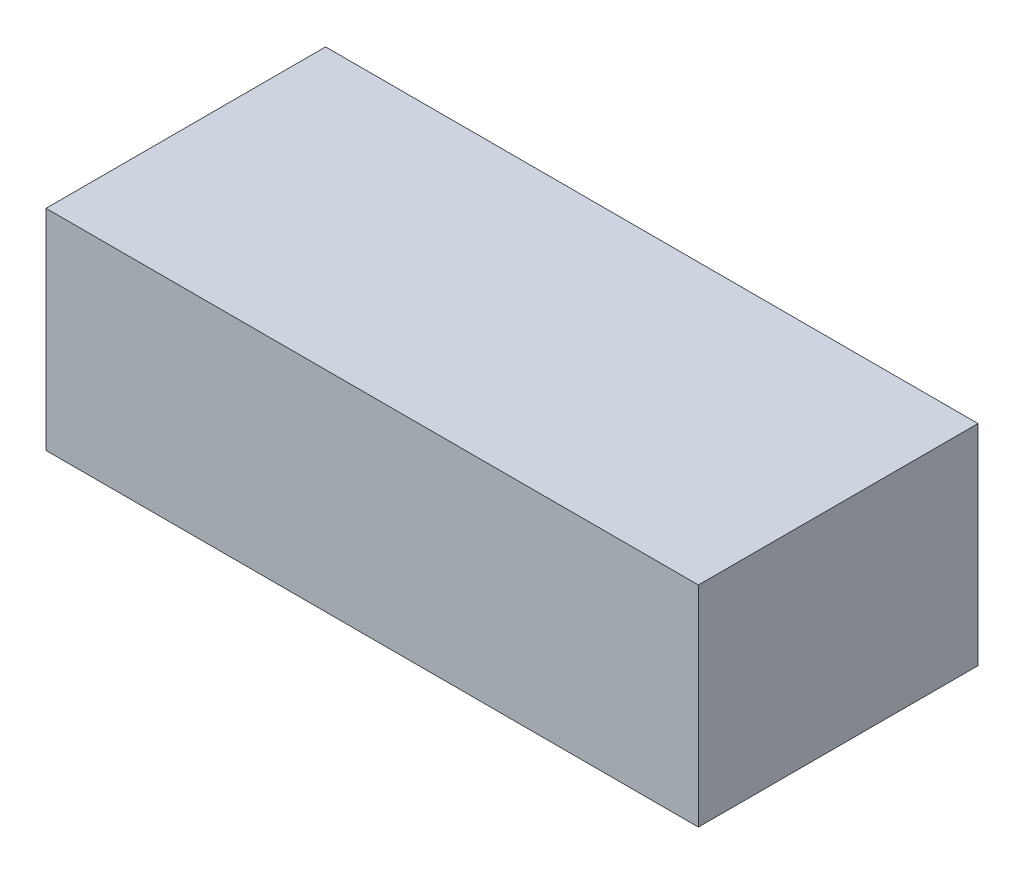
from build123d import *

# Parameters (mm, degrees)
SKETCH1_W           = 1400
SKETCH1_H           = 450
BOSS_EXTRUDE1_DEPTH = 600
SKETCH2_R           = 120
BOSS_EXTRUDE2_DEPTH = 150


with BuildPart() as part:
    # Sketch1 → Boss-Extrude1 (new body)
    with BuildSketch(Plane.XY):
        Rectangle(SKETCH1_W, SKETCH1_H)
    extrude(amount=-BOSS_EXTRUDE1_DEPTH)

    # Sketch2 → Boss-Extrude2 (add)
    with BuildSketch(Plane.XY):
        with Locations((-350, 0)):
            Circle(SKETCH2_R)
        with Locations((350, 0)):
            Circle(SKETCH2_R)
    extrude(amount=-BOSS_EXTRUDE2_DEPTH)


solid = part.part
